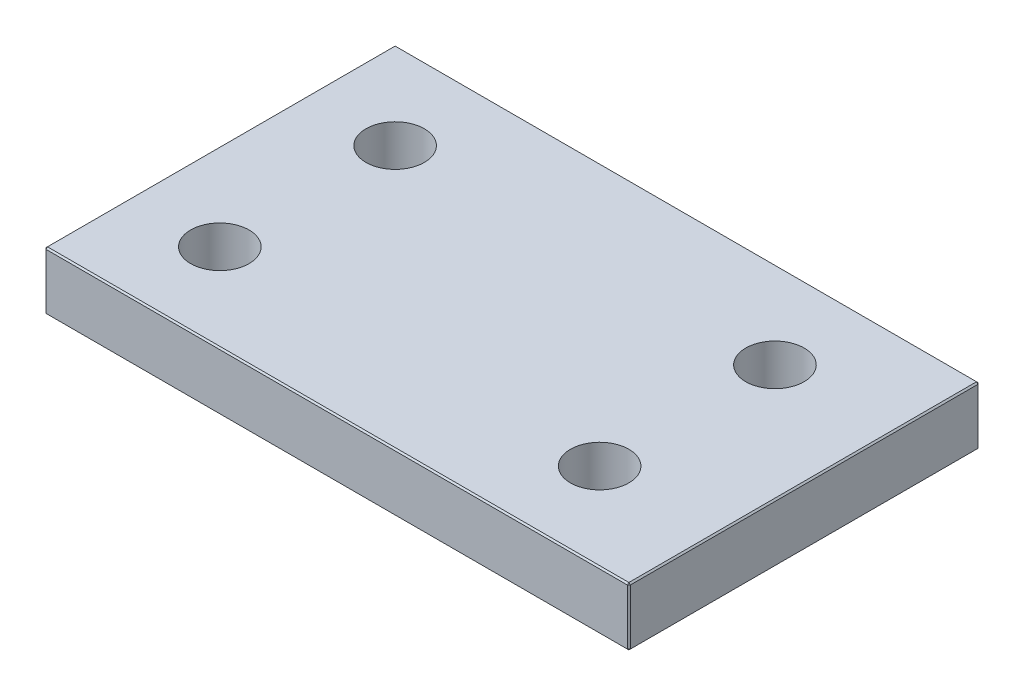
from build123d import *

# Parameters (mm, degrees)
SKETCH1_W            = 100
SKETCH1_H            = 60
EXTRUDE1_DEPTH       = 10
CHAMFER1_SIZE        = 0.25
LPATTERN4_COUNT      = 2
LPATTERN4_PITCH      = 65
LPATTERN4_COUNT_DIR2 = 2
LPATTERN4_PITCH_DIR2 = 30


with BuildPart() as part:
    # Sketch1 → Extrude1 (new body)
    with BuildSketch(Plane(origin=(0, 0, 0), x_dir=(1, 0, 0), z_dir=(0, 1, 0))):
        Rectangle(SKETCH1_W, SKETCH1_H)
    extrude(amount=EXTRUDE1_DEPTH)

    # Chamfer1
    chamfer1_edges = [part.edges().sort_by_distance(p)[0] for p in [
        (50, 10, 0),
        (0, 10, -30),
        (-50, 10, 0),
        (0, 0, -30),
        (50, 0, 0),
        (0, 0, 30),
        (-50, 0, 0),
        (0, 10, 30),
        (-50, 5, -30),
        (50, 5, -30),
        (50, 5, 30),
        (-50, 5, 30),
    ]]
    chamfer(chamfer1_edges, length=CHAMFER1_SIZE)

    # Sketch10 → 97 _0.0059_ Diameter Hole1 (revolve, cut)
    with BuildSketch(Plane(origin=(-35, 10, 15), x_dir=(0, 0, 1), z_dir=(1, 0, 0))):
        Polygon((0, 0), (0, 13.004303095), (5, 10), (5, 0), align=None)
    f_97_0_0059_diameter_hole1 = revolve(axis=Axis((-35, 16.35, 15), (0, -1, 0)), mode=Mode.SUBTRACT)

    # LPattern4: 97 _0.0059_ Diameter Hole1 2 × 2
    with Locations(*[(i * LPATTERN4_PITCH, 0, -j * LPATTERN4_PITCH_DIR2) for i in range(LPATTERN4_COUNT) for j in range(LPATTERN4_COUNT_DIR2) if (i, j) != (0, 0)]):
        add(f_97_0_0059_diameter_hole1, mode=Mode.SUBTRACT)


solid = part.part
